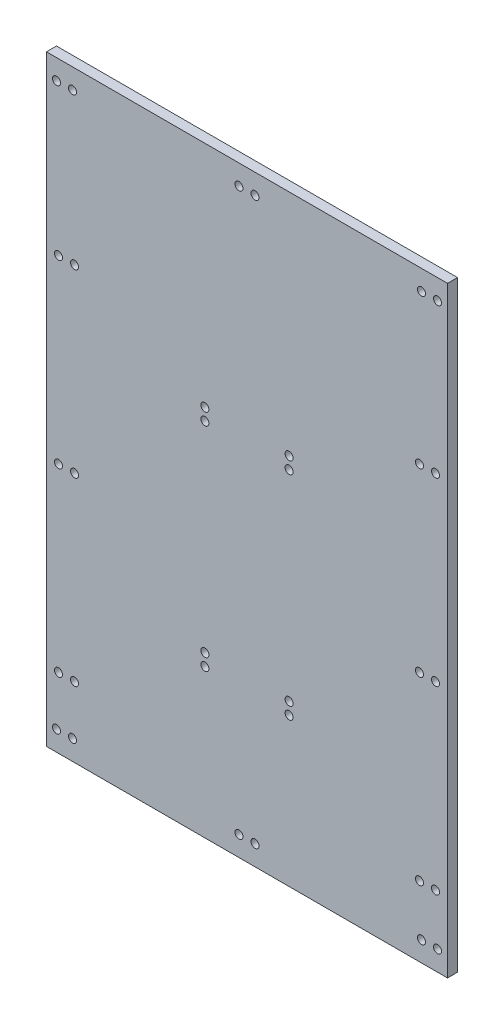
from build123d import *

# Parameters (mm, degrees)
SKETCH1_W           = 200
SKETCH1_H           = 300
BOSS_EXTRUDE1_DEPTH = 5
SKETCH2_R           = 2
CUT_EXTRUDE1_DEPTH  = 5
SKETCH3_R           = 2
CUT_EXTRUDE2_DEPTH  = 5
SKETCH4_R           = 2
CUT_EXTRUDE3_DEPTH  = 214


with BuildPart() as part:
    # Sketch1 → Boss-Extrude1 (new body)
    with BuildSketch(Plane.XY):
        Rectangle(SKETCH1_W, SKETCH1_H)
    extrude(amount=BOSS_EXTRUDE1_DEPTH)

    # Sketch2 → Cut-Extrude1 (cut)
    with BuildSketch(Plane.XY.offset(5)):
        with Locations((-86, -25)):
            Circle(SKETCH2_R)
        with Locations((-94, -25)):
            Circle(SKETCH2_R)
        with Locations(Location((86, -25, 0), (0, 0, 180))):
            Circle(SKETCH2_R)
        with Locations(Location((94, -25, 0), (0, 0, 180))):
            Circle(SKETCH2_R)
        with Locations((94, 65)):
            Circle(SKETCH2_R)
        with Locations((86, 65)):
            Circle(SKETCH2_R)
        with Locations(Location((-94, 65, 0), (0, 0, 180))):
            Circle(SKETCH2_R)
        with Locations(Location((-86, 65, 0), (0, 0, 180))):
            Circle(SKETCH2_R)
        with Locations((-86, -115)):
            Circle(SKETCH2_R)
        with Locations((-94, -115)):
            Circle(SKETCH2_R)
        with Locations(Location((86, -115, 0), (0, 0, 180))):
            Circle(SKETCH2_R)
        with Locations(Location((94, -115, 0), (0, 0, 180))):
            Circle(SKETCH2_R)
    extrude(amount=-CUT_EXTRUDE1_DEPTH, mode=Mode.SUBTRACT)

    # Sketch3 → Cut-Extrude2 (cut)
    with BuildSketch(Plane.XY.offset(5)):
        with Locations((-21, 30)):
            Circle(SKETCH3_R)
        with Locations((-21, 36)):
            Circle(SKETCH3_R)
        with Locations(Location((21, 36, 0), (0, 0, 180))):
            Circle(SKETCH3_R)
        with Locations(Location((21, 30, 0), (0, 0, 180))):
            Circle(SKETCH3_R)
        with Locations((21, -70)):
            Circle(SKETCH3_R)
        with Locations((21, -76)):
            Circle(SKETCH3_R)
        with Locations(Location((-21, -76, 0), (0, 0, 180))):
            Circle(SKETCH3_R)
        with Locations(Location((-21, -70, 0), (0, 0, 180))):
            Circle(SKETCH3_R)
    extrude(amount=-CUT_EXTRUDE2_DEPTH, mode=Mode.SUBTRACT)

    # Sketch4 → Cut-Extrude3 (cut)
    with BuildSketch(Plane.XY.offset(5)):
        with Locations((-95, 140)):
            Circle(SKETCH4_R)
        with Locations((-87, 140)):
            Circle(SKETCH4_R)
        with Locations((-4, 140)):
            Circle(SKETCH4_R)
        with Locations((4, 140)):
            Circle(SKETCH4_R)
        with Locations((95, 140)):
            Circle(SKETCH4_R)
        with Locations((87, 140)):
            Circle(SKETCH4_R)
        with Locations((87, -140)):
            Circle(SKETCH4_R)
        with Locations((95, -140)):
            Circle(SKETCH4_R)
        with Locations((4, -140)):
            Circle(SKETCH4_R)
        with Locations((-4, -140)):
            Circle(SKETCH4_R)
        with Locations((-87, -140)):
            Circle(SKETCH4_R)
        with Locations((-95, -140)):
            Circle(SKETCH4_R)
    extrude(amount=-CUT_EXTRUDE3_DEPTH, mode=Mode.SUBTRACT)


solid = part.part
